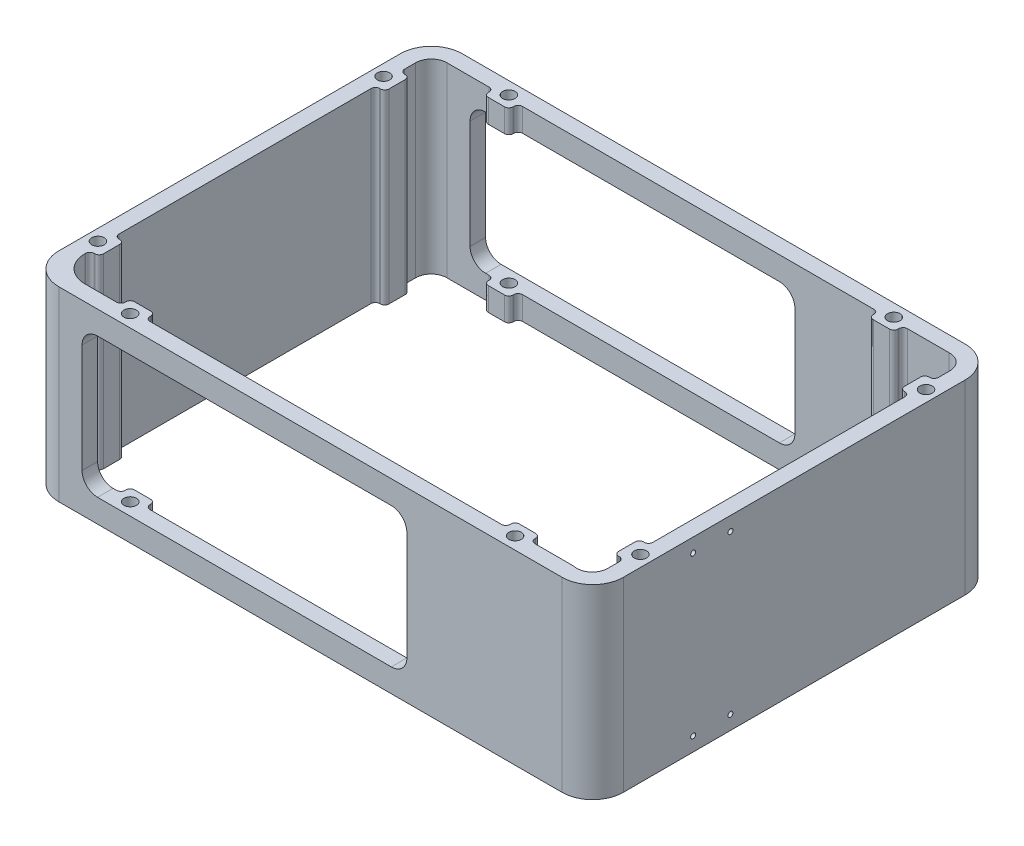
from build123d import *

# Parameters (mm, degrees)
SKETCH1_R           = 2
BOSS_EXTRUDE1_DEPTH = 60
CUT_EXTRUDE1_DEPTH  = 170.649638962
SKETCH3_R           = 0.8
CUT_EXTRUDE2_DEPTH  = 12


with BuildPart() as part:
    # Sketch1 → Boss-Extrude1 (new body)
    with BuildSketch(Plane(origin=(0, 0, 0), x_dir=(1, 0, 0), z_dir=(0, 1, 0))):
        with BuildLine():
            Line((91, 49.75), (91, -5.75))
            Line((91, -5.75), (91, -31.75))
            Line((91, -31.75), (91, -60.381931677))
            ThreePointArc((91, -60.381931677), (88.109485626, -67.360250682), (81.131166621, -70.250765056))
            Line((81.131166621, -70.250765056), (-81, -70.250765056))
            ThreePointArc((-81, -70.250765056), (-88.071067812, -67.321832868), (-91, -60.250765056))
            Line((-91, -60.250765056), (-91, 49.749234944))
            ThreePointArc((-91, 49.749234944), (-88.071067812, 56.820302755), (-81, 59.749234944))
            Line((-81, 59.749234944), (81.12369537, 59.749234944))
            ThreePointArc((81.12369537, 59.749234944), (88.11466632, 56.777198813), (91, 49.75))
        make_face()
        with Locations(Location((-87.380604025, 40.749234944, 0), (0, 0, 270))):
            Circle(SKETCH1_R, mode=Mode.SUBTRACT)
        with Locations(Location((-87.380604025, -51.250765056, 0), (0, 0, 90))):
            Circle(SKETCH1_R, mode=Mode.SUBTRACT)
        with Locations(Location((-62, 55.749234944, 0), (0, 0, 270))):
            Circle(SKETCH1_R, mode=Mode.SUBTRACT)
        with Locations(Location((-62, -66.250765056, 0), (0, 0, 90))):
            Circle(SKETCH1_R, mode=Mode.SUBTRACT)
        with Locations(Location((62, -66.250765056, 0), (0, 0, 270))):
            Circle(SKETCH1_R, mode=Mode.SUBTRACT)
        with Locations(Location((87.380604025, -51.250765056, 0), (0, 0, 270))):
            Circle(SKETCH1_R, mode=Mode.SUBTRACT)
        with Locations(Location((87.380604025, 40.749234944, 0), (0, 0, 90))):
            Circle(SKETCH1_R, mode=Mode.SUBTRACT)
        with Locations(Location((62, 55.749234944, 0), (0, 0, 90))):
            Circle(SKETCH1_R, mode=Mode.SUBTRACT)
        with BuildLine():
            Line((86, 49.75), (86, 46.137408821))
            ThreePointArc((86, 46.137408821), (85.593413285, 45.155821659), (84.611826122, 44.749234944))
            Line((84.611826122, 44.749234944), (84.388173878, 44.749234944))
            ThreePointArc((84.388173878, 44.749234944), (83.406586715, 44.342648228), (83, 43.361061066))
            Line((83, 43.361061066), (83, 38.141941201))
            ThreePointArc((83, 38.141941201), (83.408187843, 37.158755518), (84.392698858, 36.753774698))
            Line((84.392698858, 36.753774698), (84.607301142, 36.754474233))
            ThreePointArc((84.607301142, 36.754474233), (85.591812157, 36.349493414), (86, 35.366307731))
            Line((86, 35.366307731), (86, -5.75))
            Line((86, -5.75), (86, -45.862591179))
            ThreePointArc((86, -45.862591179), (85.593413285, -46.844178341), (84.611826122, -47.250765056))
            Line((84.611826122, -47.250765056), (84.388173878, -47.250765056))
            ThreePointArc((84.388173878, -47.250765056), (83.406586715, -47.657351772), (83, -48.638938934))
            Line((83, -48.638938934), (83, -53.862591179))
            ThreePointArc((83, -53.862591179), (83.406586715, -54.844178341), (84.388173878, -55.250765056))
            Line((84.388173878, -55.250765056), (84.611826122, -55.250765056))
            ThreePointArc((84.611826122, -55.250765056), (85.593413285, -55.657351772), (86, -56.638938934))
            Line((86, -56.638938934), (86, -60.381931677))
            ThreePointArc((86, -60.381931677), (84.107352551, -64.29911946), (79.86225595, -65.250765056))
            Line((79.86225595, -65.250765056), (67.388173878, -65.250765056))
            ThreePointArc((67.388173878, -65.250765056), (66.406586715, -64.844178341), (66, -63.862591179))
            Line((66, -63.862591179), (66, -63.638938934))
            ThreePointArc((66, -63.638938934), (65.593413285, -62.657351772), (64.611826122, -62.250765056))
            Line((64.611826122, -62.250765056), (59.388173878, -62.250765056))
            ThreePointArc((59.388173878, -62.250765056), (58.406586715, -62.657351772), (58, -63.638938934))
            Line((58, -63.638938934), (58, -63.862591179))
            ThreePointArc((58, -63.862591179), (57.593413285, -64.844178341), (56.611826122, -65.250765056))
            Line((56.611826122, -65.250765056), (-56.611826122, -65.250765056))
            ThreePointArc((-56.611826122, -65.250765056), (-57.593413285, -64.844178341), (-58, -63.862591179))
            Line((-58, -63.862591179), (-58, -63.638938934))
            ThreePointArc((-58, -63.638938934), (-58.406586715, -62.657351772), (-59.388173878, -62.250765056))
            Line((-59.388173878, -62.250765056), (-64.611826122, -62.250765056))
            ThreePointArc((-64.611826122, -62.250765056), (-65.593413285, -62.657351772), (-66, -63.638938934))
            Line((-66, -63.638938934), (-66, -63.862591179))
            ThreePointArc((-66, -63.862591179), (-66.406586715, -64.844178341), (-67.388173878, -65.250765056))
            Line((-67.388173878, -65.250765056), (-77.619954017, -65.250765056))
            ThreePointArc((-77.619954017, -65.250765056), (-83.545541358, -62.796306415), (-86, -56.870719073))
            Line((-86, -56.870719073), (-86, -56.638938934))
            ThreePointArc((-86, -56.638938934), (-85.593413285, -55.657351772), (-84.611826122, -55.250765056))
            Line((-84.611826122, -55.250765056), (-84.388173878, -55.250765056))
            ThreePointArc((-84.388173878, -55.250765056), (-83.406586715, -54.844178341), (-83, -53.862591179))
            Line((-83, -53.862591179), (-83, -48.638938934))
            ThreePointArc((-83, -48.638938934), (-83.406586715, -47.657351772), (-84.388173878, -47.250765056))
            Line((-84.388173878, -47.250765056), (-84.611826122, -47.250765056))
            ThreePointArc((-84.611826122, -47.250765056), (-85.593413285, -46.844178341), (-86, -45.862591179))
            Line((-86, -45.862591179), (-86, 35.361061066))
            ThreePointArc((-86, 35.361061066), (-85.593413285, 36.342648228), (-84.611826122, 36.749234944))
            Line((-84.611826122, 36.749234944), (-84.388173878, 36.749234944))
            ThreePointArc((-84.388173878, 36.749234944), (-83.406586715, 37.155821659), (-83, 38.137408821))
            Line((-83, 38.137408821), (-83, 43.361061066))
            ThreePointArc((-83, 43.361061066), (-83.406586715, 44.342648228), (-84.388173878, 44.749234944))
            Line((-84.388173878, 44.749234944), (-84.611826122, 44.749234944))
            ThreePointArc((-84.611826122, 44.749234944), (-85.593413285, 45.155821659), (-86, 46.137408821))
            Line((-86, 46.137408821), (-86, 49.744753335))
            ThreePointArc((-86, 49.744753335), (-84.537119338, 53.283184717), (-81, 54.749234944))
            Line((-81, 54.749234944), (-67.388173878, 54.749234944))
            ThreePointArc((-67.388173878, 54.749234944), (-66.406586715, 54.342648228), (-66, 53.361061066))
            Line((-66, 53.361061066), (-66, 53.137408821))
            ThreePointArc((-66, 53.137408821), (-65.593413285, 52.155821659), (-64.611826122, 51.749234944))
            Line((-64.611826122, 51.749234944), (-59.388173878, 51.749234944))
            ThreePointArc((-59.388173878, 51.749234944), (-58.406586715, 52.155821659), (-58, 53.137408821))
            Line((-58, 53.137408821), (-58, 53.361061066))
            ThreePointArc((-58, 53.361061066), (-57.593413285, 54.342648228), (-56.611826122, 54.749234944))
            Line((-56.611826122, 54.749234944), (56.611826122, 54.749234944))
            ThreePointArc((56.611826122, 54.749234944), (57.593413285, 54.342648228), (58, 53.361061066))
            Line((58, 53.361061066), (58, 53.137408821))
            ThreePointArc((58, 53.137408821), (58.406586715, 52.155821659), (59.388173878, 51.749234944))
            Line((59.388173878, 51.749234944), (64.611826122, 51.749234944))
            ThreePointArc((64.611826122, 51.749234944), (65.593413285, 52.155821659), (66, 53.137408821))
            Line((66, 53.137408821), (66, 53.361061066))
            ThreePointArc((66, 53.361061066), (66.406586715, 54.342648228), (67.388173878, 54.749234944))
            Line((67.388173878, 54.749234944), (80.771004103, 54.749234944))
            ThreePointArc((80.771004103, 54.749234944), (84.455244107, 53.368524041), (86, 49.75))
        make_face(mode=Mode.SUBTRACT)
    extrude(amount=BOSS_EXTRUDE1_DEPTH)

    # Sketch2 → Cut-Extrude1 (cut, through all)
    with BuildSketch(Plane.XY.offset(70.250765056)):
        with BuildLine():
            Line((-68.5, 7.5), (26.131166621, 7.5))
            ThreePointArc((26.131166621, 7.5), (29.666700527, 8.964466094), (31.131166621, 12.5))
            Line((31.131166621, 12.5), (31.131166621, 47.5))
            ThreePointArc((31.131166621, 47.5), (29.666700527, 51.035533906), (26.131166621, 52.5))
            Line((26.131166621, 52.5), (-68.5, 52.5))
            ThreePointArc((-68.5, 52.5), (-72.035533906, 51.035533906), (-73.5, 47.5))
            Line((-73.5, 47.5), (-73.5, 12.5))
            ThreePointArc((-73.5, 12.5), (-72.035533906, 8.964466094), (-68.5, 7.5))
        make_face()
    extrude(amount=-CUT_EXTRUDE1_DEPTH, mode=Mode.SUBTRACT)

    # Sketch3 → Cut-Extrude2 (cut)
    with BuildSketch(Plane(origin=(91, 0, 0), x_dir=(0, 0, -1), z_dir=(1, 0, 0))):
        with Locations((-37.881931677, 55.5)):
            Circle(SKETCH3_R)
        with Locations((-25.881931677, 55.5)):
            Circle(SKETCH3_R)
        with Locations(Location((-25.881931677, 4.5, 0), (0, 0, 180))):
            Circle(SKETCH3_R)
        with Locations(Location((-37.881931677, 4.5, 0), (0, 0, 180))):
            Circle(SKETCH3_R)
    extrude(amount=-CUT_EXTRUDE2_DEPTH, mode=Mode.SUBTRACT)


solid = part.part
